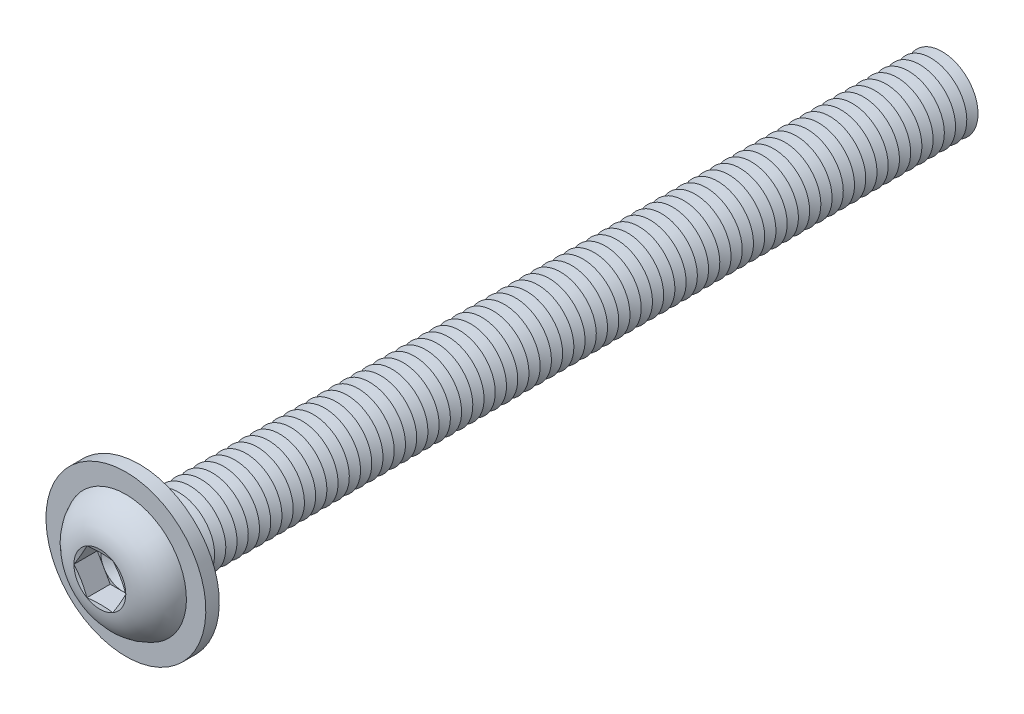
from build123d import *

# Parameters (mm, degrees)
FILLET1_R           = 0.625
LPATTERN1_COUNT     = 72
LPATTERN1_PITCH     = 1.25
CUT_EXTRUDE1_DEPTH  = 2.6
SKETCH5_R           = 8.9
SKETCH5_R_2         = 4.625
BOSS_EXTRUDE1_DEPTH = 1.5


with BuildPart() as part:
    # Sketch1 → Revolve1 (revolve)
    with BuildSketch(Plane(origin=(0, 0, 0), x_dir=(0, 0, -1), z_dir=(1, 0, 0))):
        with BuildLine():
            Line((0, 4), (0, 7))
            ThreePointArc((0, 7), (-3.011595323, 5.81154966), (-4.4, 2.88675))
            Line((-4.4, 2.88675), (-4.013248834, 1.443375))
            Line((-4.013248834, 1.443375), (-4.4, 1.443375))
            Line((-4.4, 1.443375), (-4.4, 0))
            Line((-4.4, 0), (90, 0))
            Line((90, 0), (90, 4))
            Line((90, 4), (0, 4))
        make_face()
    revolve(axis=Axis((0, 0, -90), (0, 0, 1)))

    # Fillet1
    fillet1_edges = [part.edges().sort_by_distance(p)[0] for p in [
        (0, -4, 0),
    ]]
    fillet(fillet1_edges, radius=FILLET1_R)

    # Sketch2 → Cut-Revolve1 (revolve, cut)
    with BuildSketch(Plane(origin=(0, 0, 0), x_dir=(0, 0, -1), z_dir=(1, 0, 0))):
        Polygon((89.375, 4), (90.625, 4), (90, 2.917468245), align=None)
    cut_revolve1 = revolve(axis=Axis((0, 0, -90), (0, 0, -1)), mode=Mode.SUBTRACT)

    # LPattern1: Cut-Revolve1 ×72
    with Locations(*[(0, 0, i * LPATTERN1_PITCH) for i in range(1, LPATTERN1_COUNT)]):
        add(cut_revolve1, mode=Mode.SUBTRACT)

    # Sketch3 → Cut-Extrude1 (cut)
    with BuildSketch(Plane.XY.offset(4.4)):
        Polygon((1.443375, 2.499998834), (-1.443375, 2.499998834), (-2.88675, 0), (-1.443375, -2.499998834), (1.443375, -2.499998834), (2.88675, 0), align=None)
    extrude(amount=-CUT_EXTRUDE1_DEPTH, mode=Mode.SUBTRACT)

    # Cut-Extrude2 cone 1 section (on through the dimple's axis) → Cut-Extrude2 (revolve, cut)
    with BuildSketch(Plane(origin=(0, 0, 1.8), x_dir=(0, -1, 0), z_dir=(1, 0, 0))):
        Polygon((0, 0), (2.499998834, 0), (0, 1.443375), align=None)
    revolve(axis=Axis((0, 0, 1.8), (0, 0, -1)), mode=Mode.SUBTRACT)

    # Sketch5 → Boss-Extrude1 (add)
    with BuildSketch(Plane(origin=(0, 0, 0), x_dir=(-1, 0, 0), z_dir=(0, 0, -1))):
        with Locations(Location((0, 0, 0), (0, 0, 90))):
            Circle(SKETCH5_R)
        Circle(SKETCH5_R_2, mode=Mode.SUBTRACT)
    extrude(amount=-BOSS_EXTRUDE1_DEPTH)


solid = part.part
